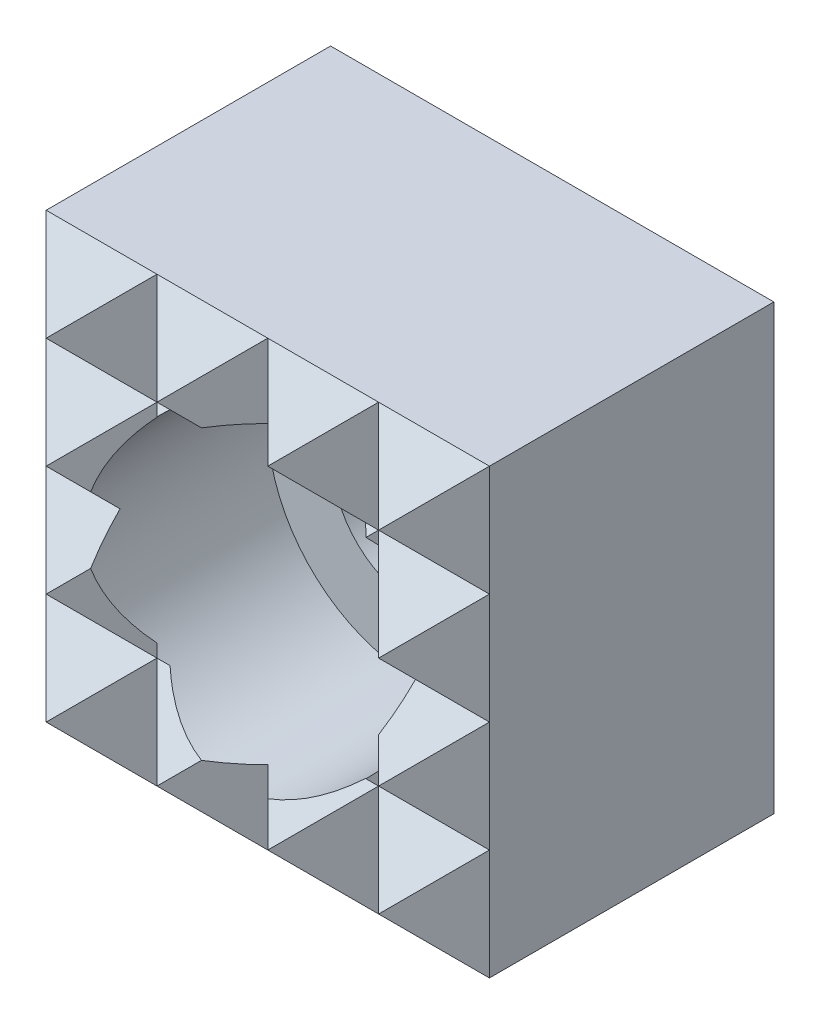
ISO-10303-21;
HEADER;
FILE_DESCRIPTION(('STEP AP214'),'2;1');
FILE_NAME('part.step','',(''),(''),'','','');
FILE_SCHEMA(('AUTOMOTIVE_DESIGN { 1 0 10303 214 1 1 1 1 }'));
ENDSEC;
DATA;
#1=APPLICATION_CONTEXT('core data for automotive mechanical design processes');
#2=APPLICATION_PROTOCOL_DEFINITION('international standard','automotive_design',2000,#1);
#3=PRODUCT_CONTEXT('',#1,'mechanical');
#4=PRODUCT('Part','Part','',(#3));
#5=PRODUCT_RELATED_PRODUCT_CATEGORY('part','',(#4));
#6=PRODUCT_DEFINITION_FORMATION('','',#4);
#7=PRODUCT_DEFINITION_CONTEXT('part definition',#1,'design');
#8=PRODUCT_DEFINITION('design','',#6,#7);
#9=PRODUCT_DEFINITION_SHAPE('','',#8);
#10=(LENGTH_UNIT() NAMED_UNIT(*) SI_UNIT(.MILLI.,.METRE.));
#11=(NAMED_UNIT(*) PLANE_ANGLE_UNIT() SI_UNIT($,.RADIAN.));
#12=(NAMED_UNIT(*) SI_UNIT($,.STERADIAN.) SOLID_ANGLE_UNIT());
#13=UNCERTAINTY_MEASURE_WITH_UNIT(LENGTH_MEASURE(1.E-05),#10,'distance_accuracy_value','');
#14=(GEOMETRIC_REPRESENTATION_CONTEXT(3) GLOBAL_UNCERTAINTY_ASSIGNED_CONTEXT((#13)) GLOBAL_UNIT_ASSIGNED_CONTEXT((#10,
#11,#12)) REPRESENTATION_CONTEXT('',''));
#15=CARTESIAN_POINT('',(0.,0.,0.));
#16=DIRECTION('',(0.,0.,1.));
#17=DIRECTION('',(1.,0.,0.));
#18=AXIS2_PLACEMENT_3D('',#15,#16,#17);
#19=CARTESIAN_POINT('',(-3.,-10.,8.5));
#20=DIRECTION('',(0.707106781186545,0.,-0.70710678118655));
#21=DIRECTION('',(-0.70710678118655,0.,-0.707106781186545));
#22=AXIS2_PLACEMENT_3D('',#19,#20,#21);
#23=PLANE('',#22);
#24=DIRECTION('',(0.,1.,0.));
#25=VECTOR('',#24,1.);
#26=CARTESIAN_POINT('',(-3.,-10.,8.5));
#27=LINE('',#26,#25);
#28=CARTESIAN_POINT('',(-3.,-3.,8.5));
#29=VERTEX_POINT('',#28);
#30=CARTESIAN_POINT('',(-3.,-2.64575131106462,8.5));
#31=VERTEX_POINT('',#30);
#32=EDGE_CURVE('E282',#29,#31,#27,.T.);
#33=ORIENTED_EDGE('',*,*,#32,.F.);
#34=DIRECTION('',(0.577350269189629,0.577350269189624,0.577350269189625));
#35=VECTOR('',#34,1.);
#36=CARTESIAN_POINT('',(-5.33333333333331,-5.33333333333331,6.16666666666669));
#37=LINE('',#36,#35);
#38=CARTESIAN_POINT('',(-2.82842712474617,-2.8284271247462,8.6715728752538));
#39=VERTEX_POINT('',#38);
#40=EDGE_CURVE('E400',#29,#39,#37,.T.);
#41=ORIENTED_EDGE('',*,*,#40,.T.);
#42=CARTESIAN_POINT('',(0.,0.,11.5));
#43=DIRECTION('',(0.707106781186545,0.,-0.70710678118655));
#44=DIRECTION('',(0.70710678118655,0.,0.707106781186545));
#45=AXIS2_PLACEMENT_3D('',#42,#43,#44);
#46=ELLIPSE('',#45,5.65685424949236,4.);
#47=EDGE_CURVE('E341',#39,#31,#46,.T.);
#48=ORIENTED_EDGE('',*,*,#47,.T.);
#49=EDGE_LOOP('',(#33,#41,#48));
#50=FACE_BOUND('',#49,.T.);
#51=ADVANCED_FACE('F14',(#50),#23,.F.);
#52=CARTESIAN_POINT('',(1.5,-10.,10.));
#53=DIRECTION('',(-0.707106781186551,0.,-0.707106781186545));
#54=DIRECTION('',(-0.707106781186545,0.,0.707106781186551));
#55=AXIS2_PLACEMENT_3D('',#52,#53,#54);
#56=PLANE('',#55);
#57=DIRECTION('',(0.,1.,0.));
#58=VECTOR('',#57,1.);
#59=CARTESIAN_POINT('',(3.,-10.,8.5));
#60=LINE('',#59,#58);
#61=CARTESIAN_POINT('',(3.,2.64575131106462,8.5));
#62=VERTEX_POINT('',#61);
#63=CARTESIAN_POINT('',(3.,3.,8.5));
#64=VERTEX_POINT('',#63);
#65=EDGE_CURVE('E702',#62,#64,#60,.T.);
#66=ORIENTED_EDGE('',*,*,#65,.T.);
#67=DIRECTION('',(-0.577350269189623,-0.577350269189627,0.577350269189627));
#68=VECTOR('',#67,1.);
#69=CARTESIAN_POINT('',(-2.33333333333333,-2.33333333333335,13.8333333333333));
#70=LINE('',#69,#68);
#71=CARTESIAN_POINT('',(2.82842712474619,2.8284271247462,8.6715728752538));
#72=VERTEX_POINT('',#71);
#73=EDGE_CURVE('E421',#64,#72,#70,.T.);
#74=ORIENTED_EDGE('',*,*,#73,.T.);
#75=CARTESIAN_POINT('',(0.,0.,11.5));
#76=DIRECTION('',(-0.707106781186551,0.,-0.707106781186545));
#77=DIRECTION('',(-0.707106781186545,0.,0.707106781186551));
#78=AXIS2_PLACEMENT_3D('',#75,#76,#77);
#79=ELLIPSE('',#78,5.6568542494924,4.);
#80=EDGE_CURVE('E353',#72,#62,#79,.T.);
#81=ORIENTED_EDGE('',*,*,#80,.T.);
#82=EDGE_LOOP('',(#66,#74,#81));
#83=FACE_BOUND('',#82,.T.);
#84=ADVANCED_FACE('F578',(#83),#56,.F.);
#85=CARTESIAN_POINT('',(-3.,2.64575131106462,8.5));
#86=VERTEX_POINT('',#85);
#87=CARTESIAN_POINT('',(-2.82842712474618,2.8284271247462,8.6715728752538));
#88=VERTEX_POINT('',#87);
#89=EDGE_CURVE('E338',#86,#88,#46,.T.);
#90=ORIENTED_EDGE('',*,*,#89,.T.);
#91=DIRECTION('',(-0.577350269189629,0.577350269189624,-0.577350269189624));
#92=VECTOR('',#91,1.);
#93=CARTESIAN_POINT('',(1.33333333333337,-1.33333333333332,12.8333333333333));
#94=LINE('',#93,#92);
#95=CARTESIAN_POINT('',(-2.99999999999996,3.,8.5));
#96=VERTEX_POINT('',#95);
#97=EDGE_CURVE('E257',#88,#96,#94,.T.);
#98=ORIENTED_EDGE('',*,*,#97,.T.);
#99=EDGE_CURVE('E279',#86,#96,#27,.T.);
#100=ORIENTED_EDGE('',*,*,#99,.F.);
#101=EDGE_LOOP('',(#90,#98,#100));
#102=FACE_BOUND('',#101,.T.);
#103=ADVANCED_FACE('F575',(#102),#23,.F.);
#104=CARTESIAN_POINT('',(3.,-2.64575131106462,8.5));
#105=VERTEX_POINT('',#104);
#106=CARTESIAN_POINT('',(2.82842712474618,-2.8284271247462,8.6715728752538));
#107=VERTEX_POINT('',#106);
#108=EDGE_CURVE('E350',#105,#107,#79,.T.);
#109=ORIENTED_EDGE('',*,*,#108,.T.);
#110=DIRECTION('',(0.577350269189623,-0.577350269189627,-0.577350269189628));
#111=VECTOR('',#110,1.);
#112=CARTESIAN_POINT('',(4.33333333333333,-4.33333333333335,7.16666666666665));
#113=LINE('',#112,#111);
#114=CARTESIAN_POINT('',(3.,-3.,8.5));
#115=VERTEX_POINT('',#114);
#116=EDGE_CURVE('E465',#107,#115,#113,.T.);
#117=ORIENTED_EDGE('',*,*,#116,.T.);
#118=EDGE_CURVE('E704',#115,#105,#60,.T.);
#119=ORIENTED_EDGE('',*,*,#118,.T.);
#120=EDGE_LOOP('',(#109,#117,#119));
#121=FACE_BOUND('',#120,.T.);
#122=ADVANCED_FACE('F577',(#121),#56,.F.);
#123=CARTESIAN_POINT('',(3.,-10.,8.5));
#124=DIRECTION('',(0.707106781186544,0.,-0.707106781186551));
#125=DIRECTION('',(-0.707106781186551,0.,-0.707106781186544));
#126=AXIS2_PLACEMENT_3D('',#123,#124,#125);
#127=PLANE('',#126);
#128=DIRECTION('',(0.57735026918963,0.577350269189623,0.577350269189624));
#129=VECTOR('',#128,1.);
#130=CARTESIAN_POINT('',(0.666666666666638,-5.33333333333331,6.16666666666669));
#131=LINE('',#130,#129);
#132=CARTESIAN_POINT('',(4.49999999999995,-1.5,10.));
#133=VERTEX_POINT('',#132);
#134=EDGE_CURVE('E468',#115,#133,#131,.T.);
#135=ORIENTED_EDGE('',*,*,#134,.T.);
#136=DIRECTION('',(-0.57735026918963,0.577350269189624,-0.577350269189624));
#137=VECTOR('',#136,1.);
#138=CARTESIAN_POINT('',(6.33333333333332,-3.33333333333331,11.8333333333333));
#139=LINE('',#138,#137);
#140=CARTESIAN_POINT('',(3.89791576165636,-0.897915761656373,9.39791576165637));
#141=VERTEX_POINT('',#140);
#142=EDGE_CURVE('E453',#133,#141,#139,.T.);
#143=ORIENTED_EDGE('',*,*,#142,.T.);
#144=CARTESIAN_POINT('',(0.,0.,5.5));
#145=DIRECTION('',(0.707106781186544,0.,-0.707106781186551));
#146=DIRECTION('',(0.707106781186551,0.,0.707106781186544));
#147=AXIS2_PLACEMENT_3D('',#144,#145,#146);
#148=ELLIPSE('',#147,5.65685424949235,4.);
#149=EDGE_CURVE('E357',#141,#105,#148,.T.);
#150=ORIENTED_EDGE('',*,*,#149,.T.);
#151=ORIENTED_EDGE('',*,*,#118,.F.);
#152=EDGE_LOOP('',(#135,#143,#150,#151));
#153=FACE_BOUND('',#152,.T.);
#154=ADVANCED_FACE('F586',(#153),#127,.F.);
#155=CARTESIAN_POINT('',(3.89791576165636,0.897915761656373,9.39791576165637));
#156=VERTEX_POINT('',#155);
#157=EDGE_CURVE('E354',#62,#156,#148,.T.);
#158=ORIENTED_EDGE('',*,*,#157,.T.);
#159=DIRECTION('',(0.57735026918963,0.577350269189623,0.577350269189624));
#160=VECTOR('',#159,1.);
#161=CARTESIAN_POINT('',(-0.333333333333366,-3.33333333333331,5.16666666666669));
#162=LINE('',#161,#160);
#163=CARTESIAN_POINT('',(4.49999999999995,1.5,10.));
#164=VERTEX_POINT('',#163);
#165=EDGE_CURVE('E443',#156,#164,#162,.T.);
#166=ORIENTED_EDGE('',*,*,#165,.T.);
#167=DIRECTION('',(-0.57735026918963,0.577350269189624,-0.577350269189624));
#168=VECTOR('',#167,1.);
#169=CARTESIAN_POINT('',(7.33333333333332,-1.33333333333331,12.8333333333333));
#170=LINE('',#169,#168);
#171=EDGE_CURVE('E429',#164,#64,#170,.T.);
#172=ORIENTED_EDGE('',*,*,#171,.T.);
#173=ORIENTED_EDGE('',*,*,#65,.F.);
#174=EDGE_LOOP('',(#158,#166,#172,#173));
#175=FACE_BOUND('',#174,.T.);
#176=ADVANCED_FACE('F764',(#175),#127,.F.);
#177=CARTESIAN_POINT('',(4.5,-10.,10.));
#178=DIRECTION('',(-0.707106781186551,0.,-0.707106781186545));
#179=DIRECTION('',(-0.707106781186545,0.,0.707106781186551));
#180=AXIS2_PLACEMENT_3D('',#177,#178,#179);
#181=PLANE('',#180);
#182=DIRECTION('',(-0.577350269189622,-0.577350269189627,0.577350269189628));
#183=VECTOR('',#182,1.);
#184=CARTESIAN_POINT('',(2.66666666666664,-6.33333333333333,11.8333333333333));
#185=LINE('',#184,#183);
#186=CARTESIAN_POINT('',(6.,-3.,8.5));
#187=VERTEX_POINT('',#186);
#188=CARTESIAN_POINT('',(4.5,-4.5,10.));
#189=VERTEX_POINT('',#188);
#190=EDGE_CURVE('E486',#187,#189,#185,.T.);
#191=ORIENTED_EDGE('',*,*,#190,.T.);
#192=DIRECTION('',(0.577350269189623,-0.577350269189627,-0.577350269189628));
#193=VECTOR('',#192,1.);
#194=CARTESIAN_POINT('',(6.33333333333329,-6.33333333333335,8.16666666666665));
#195=LINE('',#194,#193);
#196=CARTESIAN_POINT('',(6.,-6.,8.5));
#197=VERTEX_POINT('',#196);
#198=EDGE_CURVE('E494',#189,#197,#195,.T.);
#199=ORIENTED_EDGE('',*,*,#198,.T.);
#200=DIRECTION('',(0.,1.,0.));
#201=VECTOR('',#200,1.);
#202=CARTESIAN_POINT('',(6.,-10.,8.5));
#203=LINE('',#202,#201);
#204=EDGE_CURVE('E277',#197,#187,#203,.T.);
#205=ORIENTED_EDGE('',*,*,#204,.T.);
#206=EDGE_LOOP('',(#191,#199,#205));
#207=FACE_BOUND('',#206,.T.);
#208=ADVANCED_FACE('F735',(#207),#181,.F.);
#209=DIRECTION('',(-0.577350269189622,-0.577350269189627,0.577350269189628));
#210=VECTOR('',#209,1.);
#211=CARTESIAN_POINT('',(1.66666666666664,-4.33333333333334,12.8333333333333));
#212=LINE('',#211,#210);
#213=CARTESIAN_POINT('',(6.,0.,8.5));
#214=VERTEX_POINT('',#213);
#215=EDGE_CURVE('E456',#214,#133,#212,.T.);
#216=ORIENTED_EDGE('',*,*,#215,.T.);
#217=DIRECTION('',(0.577350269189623,-0.577350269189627,-0.577350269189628));
#218=VECTOR('',#217,1.);
#219=CARTESIAN_POINT('',(7.33333333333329,-4.33333333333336,7.16666666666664));
#220=LINE('',#219,#218);
#221=EDGE_CURVE('E471',#133,#187,#220,.T.);
#222=ORIENTED_EDGE('',*,*,#221,.T.);
#223=EDGE_CURVE('E696',#187,#214,#203,.T.);
#224=ORIENTED_EDGE('',*,*,#223,.T.);
#225=EDGE_LOOP('',(#216,#222,#224));
#226=FACE_BOUND('',#225,.T.);
#227=ADVANCED_FACE('F776',(#226),#181,.F.);
#228=DIRECTION('',(-0.577350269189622,-0.577350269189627,0.577350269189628));
#229=VECTOR('',#228,1.);
#230=CARTESIAN_POINT('',(0.666666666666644,-2.33333333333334,13.8333333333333));
#231=LINE('',#230,#229);
#232=CARTESIAN_POINT('',(6.,3.,8.5));
#233=VERTEX_POINT('',#232);
#234=EDGE_CURVE('E433',#233,#164,#231,.T.);
#235=ORIENTED_EDGE('',*,*,#234,.T.);
#236=DIRECTION('',(0.577350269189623,-0.577350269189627,-0.577350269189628));
#237=VECTOR('',#236,1.);
#238=CARTESIAN_POINT('',(8.33333333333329,-2.33333333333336,6.16666666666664));
#239=LINE('',#238,#237);
#240=EDGE_CURVE('E446',#164,#214,#239,.T.);
#241=ORIENTED_EDGE('',*,*,#240,.T.);
#242=EDGE_CURVE('E693',#214,#233,#203,.T.);
#243=ORIENTED_EDGE('',*,*,#242,.T.);
#244=EDGE_LOOP('',(#235,#241,#243));
#245=FACE_BOUND('',#244,.T.);
#246=ADVANCED_FACE('F695',(#245),#181,.F.);
#247=CARTESIAN_POINT('',(-6.,-10.,8.5));
#248=DIRECTION('',(0.707106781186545,0.,-0.70710678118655));
#249=DIRECTION('',(-0.70710678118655,0.,-0.707106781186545));
#250=AXIS2_PLACEMENT_3D('',#247,#248,#249);
#251=PLANE('',#250);
#252=DIRECTION('',(0.,1.,0.));
#253=VECTOR('',#252,1.);
#254=CARTESIAN_POINT('',(-6.,-10.,8.5));
#255=LINE('',#254,#253);
#256=CARTESIAN_POINT('',(-6.,-6.,8.5));
#257=VERTEX_POINT('',#256);
#258=CARTESIAN_POINT('',(-6.,-3.,8.5));
#259=VERTEX_POINT('',#258);
#260=EDGE_CURVE('E268',#257,#259,#255,.T.);
#261=ORIENTED_EDGE('',*,*,#260,.F.);
#262=DIRECTION('',(0.577350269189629,0.577350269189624,0.577350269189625));
#263=VECTOR('',#262,1.);
#264=CARTESIAN_POINT('',(-7.33333333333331,-7.33333333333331,7.16666666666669));
#265=LINE('',#264,#263);
#266=CARTESIAN_POINT('',(-4.49999999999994,-4.5,10.));
#267=VERTEX_POINT('',#266);
#268=EDGE_CURVE('E509',#257,#267,#265,.T.);
#269=ORIENTED_EDGE('',*,*,#268,.T.);
#270=DIRECTION('',(-0.577350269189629,0.577350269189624,-0.577350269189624));
#271=VECTOR('',#270,1.);
#272=CARTESIAN_POINT('',(-3.66666666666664,-5.33333333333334,10.8333333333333));
#273=LINE('',#272,#271);
#274=EDGE_CURVE('E393',#267,#259,#273,.T.);
#275=ORIENTED_EDGE('',*,*,#274,.T.);
#276=EDGE_LOOP('',(#261,#269,#275));
#277=FACE_BOUND('',#276,.T.);
#278=ADVANCED_FACE('F797',(#277),#251,.F.);
#279=CARTESIAN_POINT('',(-6.,0.,8.5));
#280=VERTEX_POINT('',#279);
#281=EDGE_CURVE('E273',#259,#280,#255,.T.);
#282=ORIENTED_EDGE('',*,*,#281,.F.);
#283=DIRECTION('',(0.577350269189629,0.577350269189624,0.577350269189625));
#284=VECTOR('',#283,1.);
#285=CARTESIAN_POINT('',(-8.33333333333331,-5.3333333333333,6.16666666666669));
#286=LINE('',#285,#284);
#287=CARTESIAN_POINT('',(-4.49999999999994,-1.5,10.));
#288=VERTEX_POINT('',#287);
#289=EDGE_CURVE('E381',#259,#288,#286,.T.);
#290=ORIENTED_EDGE('',*,*,#289,.T.);
#291=DIRECTION('',(-0.577350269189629,0.577350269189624,-0.577350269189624));
#292=VECTOR('',#291,1.);
#293=CARTESIAN_POINT('',(-2.66666666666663,-3.33333333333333,11.8333333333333));
#294=LINE('',#293,#292);
#295=EDGE_CURVE('E461',#288,#280,#294,.T.);
#296=ORIENTED_EDGE('',*,*,#295,.T.);
#297=EDGE_LOOP('',(#282,#290,#296));
#298=FACE_BOUND('',#297,.T.);
#299=ADVANCED_FACE('F799',(#298),#251,.F.);
#300=CARTESIAN_POINT('',(-6.,3.,8.5));
#301=VERTEX_POINT('',#300);
#302=EDGE_CURVE('E254',#280,#301,#255,.T.);
#303=ORIENTED_EDGE('',*,*,#302,.F.);
#304=DIRECTION('',(0.577350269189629,0.577350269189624,0.577350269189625));
#305=VECTOR('',#304,1.);
#306=CARTESIAN_POINT('',(-9.33333333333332,-3.33333333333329,5.1666666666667));
#307=LINE('',#306,#305);
#308=CARTESIAN_POINT('',(-4.49999999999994,1.5,10.));
#309=VERTEX_POINT('',#308);
#310=EDGE_CURVE('E256',#280,#309,#307,.T.);
#311=ORIENTED_EDGE('',*,*,#310,.T.);
#312=DIRECTION('',(-0.577350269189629,0.577350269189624,-0.577350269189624));
#313=VECTOR('',#312,1.);
#314=CARTESIAN_POINT('',(-1.66666666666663,-1.33333333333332,12.8333333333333));
#315=LINE('',#314,#313);
#316=EDGE_CURVE('E241',#309,#301,#315,.T.);
#317=ORIENTED_EDGE('',*,*,#316,.T.);
#318=EDGE_LOOP('',(#303,#311,#317));
#319=FACE_BOUND('',#318,.T.);
#320=ADVANCED_FACE('F252',(#319),#251,.F.);
#321=CARTESIAN_POINT('',(-4.5,-10.,10.));
#322=DIRECTION('',(-0.70710678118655,0.,-0.707106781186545));
#323=DIRECTION('',(-0.707106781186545,0.,0.70710678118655));
#324=AXIS2_PLACEMENT_3D('',#321,#322,#323);
#325=PLANE('',#324);
#326=CARTESIAN_POINT('',(0.,0.,5.5));
#327=DIRECTION('',(-0.70710678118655,0.,-0.707106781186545));
#328=DIRECTION('',(-0.707106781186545,0.,0.70710678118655));
#329=AXIS2_PLACEMENT_3D('',#326,#327,#328);
#330=ELLIPSE('',#329,5.6568542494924,4.);
#331=CARTESIAN_POINT('',(-3.89791576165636,-0.897915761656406,9.3979157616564));
#332=VERTEX_POINT('',#331);
#333=EDGE_CURVE('E335',#31,#332,#330,.T.);
#334=ORIENTED_EDGE('',*,*,#333,.T.);
#335=DIRECTION('',(-0.577350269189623,-0.577350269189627,0.577350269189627));
#336=VECTOR('',#335,1.);
#337=CARTESIAN_POINT('',(-7.33333333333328,-4.33333333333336,12.8333333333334));
#338=LINE('',#337,#336);
#339=EDGE_CURVE('E9',#332,#288,#338,.T.);
#340=ORIENTED_EDGE('',*,*,#339,.T.);
#341=DIRECTION('',(0.577350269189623,-0.577350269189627,-0.577350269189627));
#342=VECTOR('',#341,1.);
#343=CARTESIAN_POINT('',(-1.66666666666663,-4.33333333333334,7.16666666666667));
#344=LINE('',#343,#342);
#345=EDGE_CURVE('E22',#288,#29,#344,.T.);
#346=ORIENTED_EDGE('',*,*,#345,.T.);
#347=ORIENTED_EDGE('',*,*,#32,.T.);
#348=EDGE_LOOP('',(#334,#340,#346,#347));
#349=FACE_BOUND('',#348,.T.);
#350=ADVANCED_FACE('F374',(#349),#325,.F.);
#351=DIRECTION('',(-0.577350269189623,-0.577350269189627,0.577350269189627));
#352=VECTOR('',#351,1.);
#353=CARTESIAN_POINT('',(-8.33333333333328,-2.33333333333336,13.8333333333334));
#354=LINE('',#353,#352);
#355=EDGE_CURVE('E244',#96,#309,#354,.T.);
#356=ORIENTED_EDGE('',*,*,#355,.T.);
#357=DIRECTION('',(0.577350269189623,-0.577350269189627,-0.577350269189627));
#358=VECTOR('',#357,1.);
#359=CARTESIAN_POINT('',(-0.666666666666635,-2.33333333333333,6.16666666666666));
#360=LINE('',#359,#358);
#361=CARTESIAN_POINT('',(-3.89791576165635,0.897915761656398,9.3979157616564));
#362=VERTEX_POINT('',#361);
#363=EDGE_CURVE('E362',#309,#362,#360,.T.);
#364=ORIENTED_EDGE('',*,*,#363,.T.);
#365=EDGE_CURVE('E323',#362,#86,#330,.T.);
#366=ORIENTED_EDGE('',*,*,#365,.T.);
#367=ORIENTED_EDGE('',*,*,#99,.T.);
#368=EDGE_LOOP('',(#356,#364,#366,#367));
#369=FACE_BOUND('',#368,.T.);
#370=ADVANCED_FACE('F574',(#369),#325,.F.);
#371=CARTESIAN_POINT('',(-6.,-6.,0.));
#372=DIRECTION('',(0.,0.,-1.));
#373=DIRECTION('',(-1.,0.,0.));
#374=AXIS2_PLACEMENT_3D('',#371,#372,#373);
#375=PLANE('',#374);
#376=DIRECTION('',(1.,0.,0.));
#377=VECTOR('',#376,1.);
#378=CARTESIAN_POINT('',(-6.,5.2,0.));
#379=LINE('',#378,#377);
#380=CARTESIAN_POINT('',(-5.2,5.2,0.));
#381=VERTEX_POINT('',#380);
#382=CARTESIAN_POINT('',(5.2,5.2,0.));
#383=VERTEX_POINT('',#382);
#384=EDGE_CURVE('E305',#381,#383,#379,.T.);
#385=ORIENTED_EDGE('',*,*,#384,.T.);
#386=DIRECTION('',(0.,-1.,0.));
#387=VECTOR('',#386,1.);
#388=CARTESIAN_POINT('',(5.2,-6.,0.));
#389=LINE('',#388,#387);
#390=CARTESIAN_POINT('',(5.2,-5.2,0.));
#391=VERTEX_POINT('',#390);
#392=EDGE_CURVE('E311',#383,#391,#389,.T.);
#393=ORIENTED_EDGE('',*,*,#392,.T.);
#394=DIRECTION('',(-1.,0.,0.));
#395=VECTOR('',#394,1.);
#396=CARTESIAN_POINT('',(-6.,-5.2,0.));
#397=LINE('',#396,#395);
#398=CARTESIAN_POINT('',(-5.2,-5.2,0.));
#399=VERTEX_POINT('',#398);
#400=EDGE_CURVE('E309',#391,#399,#397,.T.);
#401=ORIENTED_EDGE('',*,*,#400,.T.);
#402=DIRECTION('',(0.,1.,0.));
#403=VECTOR('',#402,1.);
#404=CARTESIAN_POINT('',(-5.2,6.,0.));
#405=LINE('',#404,#403);
#406=EDGE_CURVE('E307',#399,#381,#405,.T.);
#407=ORIENTED_EDGE('',*,*,#406,.T.);
#408=EDGE_LOOP('',(#385,#393,#401,#407));
#409=FACE_BOUND('',#408,.T.);
#410=CARTESIAN_POINT('',(0.,0.,0.));
#411=DIRECTION('',(0.,0.,-1.));
#412=DIRECTION('',(-1.,0.,0.));
#413=AXIS2_PLACEMENT_3D('',#410,#411,#412);
#414=CIRCLE('',#413,2.25);
#415=CARTESIAN_POINT('',(-2.25,0.,0.));
#416=VERTEX_POINT('',#415);
#417=EDGE_CURVE('E291',#416,#416,#414,.F.);
#418=ORIENTED_EDGE('',*,*,#417,.T.);
#419=EDGE_LOOP('',(#418));
#420=FACE_BOUND('',#419,.T.);
#421=ADVANCED_FACE('F1075',(#409,#420),#375,.T.);
#422=CARTESIAN_POINT('',(-6.,6.,10.));
#423=DIRECTION('',(1.,0.,0.));
#424=DIRECTION('',(0.,1.,0.));
#425=AXIS2_PLACEMENT_3D('',#422,#423,#424);
#426=PLANE('',#425);
#427=DIRECTION('',(0.,0.,-1.));
#428=VECTOR('',#427,1.);
#429=CARTESIAN_POINT('',(-6.,-6.,10.));
#430=LINE('',#429,#428);
#431=CARTESIAN_POINT('',(-6.,-6.,0.8));
#432=VERTEX_POINT('',#431);
#433=EDGE_CURVE('E298',#257,#432,#430,.T.);
#434=ORIENTED_EDGE('',*,*,#433,.F.);
#435=ORIENTED_EDGE('',*,*,#260,.T.);
#436=ORIENTED_EDGE('',*,*,#281,.T.);
#437=ORIENTED_EDGE('',*,*,#302,.T.);
#438=CARTESIAN_POINT('',(-6.,6.,8.5));
#439=VERTEX_POINT('',#438);
#440=EDGE_CURVE('E261',#301,#439,#255,.T.);
#441=ORIENTED_EDGE('',*,*,#440,.T.);
#442=DIRECTION('',(0.,0.,-1.));
#443=VECTOR('',#442,1.);
#444=CARTESIAN_POINT('',(-6.,6.,10.));
#445=LINE('',#444,#443);
#446=CARTESIAN_POINT('',(-6.,6.,0.8));
#447=VERTEX_POINT('',#446);
#448=EDGE_CURVE('E292',#439,#447,#445,.T.);
#449=ORIENTED_EDGE('',*,*,#448,.T.);
#450=DIRECTION('',(0.,-1.,0.));
#451=VECTOR('',#450,1.);
#452=CARTESIAN_POINT('',(-6.,-6.,0.8));
#453=LINE('',#452,#451);
#454=EDGE_CURVE('E317',#447,#432,#453,.T.);
#455=ORIENTED_EDGE('',*,*,#454,.T.);
#456=EDGE_LOOP('',(#434,#435,#436,#437,#441,#449,#455));
#457=FACE_BOUND('',#456,.T.);
#458=ADVANCED_FACE('F270',(#457),#426,.F.);
#459=CARTESIAN_POINT('',(6.,-6.,10.));
#460=DIRECTION('',(0.,-1.,0.));
#461=DIRECTION('',(1.,0.,0.));
#462=AXIS2_PLACEMENT_3D('',#459,#460,#461);
#463=PLANE('',#462);
#464=DIRECTION('',(1.,0.,0.));
#465=VECTOR('',#464,1.);
#466=CARTESIAN_POINT('',(-10.,-6.,8.5));
#467=LINE('',#466,#465);
#468=CARTESIAN_POINT('',(-2.99999999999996,-6.,8.5));
#469=VERTEX_POINT('',#468);
#470=EDGE_CURVE('E555',#257,#469,#467,.T.);
#471=ORIENTED_EDGE('',*,*,#470,.F.);
#472=ORIENTED_EDGE('',*,*,#433,.T.);
#473=DIRECTION('',(1.,0.,0.));
#474=VECTOR('',#473,1.);
#475=CARTESIAN_POINT('',(6.,-6.,0.8));
#476=LINE('',#475,#474);
#477=CARTESIAN_POINT('',(6.,-6.,0.8));
#478=VERTEX_POINT('',#477);
#479=EDGE_CURVE('E314',#432,#478,#476,.T.);
#480=ORIENTED_EDGE('',*,*,#479,.T.);
#481=DIRECTION('',(0.,0.,-1.));
#482=VECTOR('',#481,1.);
#483=CARTESIAN_POINT('',(6.,-6.,10.));
#484=LINE('',#483,#482);
#485=EDGE_CURVE('E296',#197,#478,#484,.T.);
#486=ORIENTED_EDGE('',*,*,#485,.F.);
#487=CARTESIAN_POINT('',(3.,-6.,8.5));
#488=VERTEX_POINT('',#487);
#489=EDGE_CURVE('E553',#488,#197,#467,.T.);
#490=ORIENTED_EDGE('',*,*,#489,.F.);
#491=CARTESIAN_POINT('',(0.,-6.,8.5));
#492=VERTEX_POINT('',#491);
#493=EDGE_CURVE('E554',#492,#488,#467,.T.);
#494=ORIENTED_EDGE('',*,*,#493,.F.);
#495=EDGE_CURVE('E750',#469,#492,#467,.T.);
#496=ORIENTED_EDGE('',*,*,#495,.F.);
#497=EDGE_LOOP('',(#471,#472,#480,#486,#490,#494,#496));
#498=FACE_BOUND('',#497,.T.);
#499=ADVANCED_FACE('F744',(#498),#463,.T.);
#500=CARTESIAN_POINT('',(6.,-6.,10.));
#501=DIRECTION('',(-1.,0.,0.));
#502=DIRECTION('',(0.,0.,1.));
#503=AXIS2_PLACEMENT_3D('',#500,#501,#502);
#504=PLANE('',#503);
#505=DIRECTION('',(0.,0.,-1.));
#506=VECTOR('',#505,1.);
#507=CARTESIAN_POINT('',(6.,6.,10.));
#508=LINE('',#507,#506);
#509=CARTESIAN_POINT('',(6.,6.,8.5));
#510=VERTEX_POINT('',#509);
#511=CARTESIAN_POINT('',(6.,6.,0.8));
#512=VERTEX_POINT('',#511);
#513=EDGE_CURVE('E294',#510,#512,#508,.T.);
#514=ORIENTED_EDGE('',*,*,#513,.F.);
#515=EDGE_CURVE('E276',#233,#510,#203,.T.);
#516=ORIENTED_EDGE('',*,*,#515,.F.);
#517=ORIENTED_EDGE('',*,*,#242,.F.);
#518=ORIENTED_EDGE('',*,*,#223,.F.);
#519=ORIENTED_EDGE('',*,*,#204,.F.);
#520=ORIENTED_EDGE('',*,*,#485,.T.);
#521=DIRECTION('',(0.,1.,0.));
#522=VECTOR('',#521,1.);
#523=CARTESIAN_POINT('',(6.,6.,0.8));
#524=LINE('',#523,#522);
#525=EDGE_CURVE('E300',#478,#512,#524,.T.);
#526=ORIENTED_EDGE('',*,*,#525,.T.);
#527=EDGE_LOOP('',(#514,#516,#517,#518,#519,#520,#526));
#528=FACE_BOUND('',#527,.T.);
#529=ADVANCED_FACE('F691',(#528),#504,.F.);
#530=CARTESIAN_POINT('',(-6.,6.,10.));
#531=DIRECTION('',(0.,1.,0.));
#532=DIRECTION('',(0.,0.,1.));
#533=AXIS2_PLACEMENT_3D('',#530,#531,#532);
#534=PLANE('',#533);
#535=DIRECTION('',(1.,0.,0.));
#536=VECTOR('',#535,1.);
#537=CARTESIAN_POINT('',(-10.,6.,8.5));
#538=LINE('',#537,#536);
#539=CARTESIAN_POINT('',(3.,6.,8.5));
#540=VERTEX_POINT('',#539);
#541=EDGE_CURVE('E245',#540,#510,#538,.T.);
#542=ORIENTED_EDGE('',*,*,#541,.T.);
#543=ORIENTED_EDGE('',*,*,#513,.T.);
#544=DIRECTION('',(-1.,0.,0.));
#545=VECTOR('',#544,1.);
#546=CARTESIAN_POINT('',(-6.,6.,0.8));
#547=LINE('',#546,#545);
#548=EDGE_CURVE('E320',#512,#447,#547,.T.);
#549=ORIENTED_EDGE('',*,*,#548,.T.);
#550=ORIENTED_EDGE('',*,*,#448,.F.);
#551=CARTESIAN_POINT('',(-2.99999999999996,6.,8.5));
#552=VERTEX_POINT('',#551);
#553=EDGE_CURVE('E552',#439,#552,#538,.T.);
#554=ORIENTED_EDGE('',*,*,#553,.T.);
#555=CARTESIAN_POINT('',(0.,6.,8.5));
#556=VERTEX_POINT('',#555);
#557=EDGE_CURVE('E618',#552,#556,#538,.T.);
#558=ORIENTED_EDGE('',*,*,#557,.T.);
#559=EDGE_CURVE('E551',#556,#540,#538,.T.);
#560=ORIENTED_EDGE('',*,*,#559,.T.);
#561=EDGE_LOOP('',(#542,#543,#549,#550,#554,#558,#560));
#562=FACE_BOUND('',#561,.T.);
#563=ADVANCED_FACE('F630',(#562),#534,.T.);
#564=CARTESIAN_POINT('',(0.,0.,10.));
#565=DIRECTION('',(0.,0.,1.));
#566=DIRECTION('',(1.,0.,0.));
#567=AXIS2_PLACEMENT_3D('',#564,#565,#566);
#568=CYLINDRICAL_SURFACE('',#567,4.);
#569=CARTESIAN_POINT('',(0.,0.,8.5));
#570=DIRECTION('',(0.,0.707106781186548,-0.707106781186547));
#571=DIRECTION('',(0.,0.707106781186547,0.707106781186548));
#572=AXIS2_PLACEMENT_3D('',#569,#570,#571);
#573=ELLIPSE('',#572,5.65685424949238,4.);
#574=CARTESIAN_POINT('',(-4.,0.,8.5));
#575=VERTEX_POINT('',#574);
#576=EDGE_CURVE('E449',#575,#362,#573,.T.);
#577=ORIENTED_EDGE('',*,*,#576,.F.);
#578=CARTESIAN_POINT('',(0.,0.,8.5));
#579=DIRECTION('',(0.,-0.707106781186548,-0.707106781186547));
#580=DIRECTION('',(0.,-0.707106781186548,0.707106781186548));
#581=AXIS2_PLACEMENT_3D('',#578,#579,#580);
#582=ELLIPSE('',#581,5.65685424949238,4.);
#583=EDGE_CURVE('E459',#332,#575,#582,.T.);
#584=ORIENTED_EDGE('',*,*,#583,.F.);
#585=ORIENTED_EDGE('',*,*,#333,.F.);
#586=ORIENTED_EDGE('',*,*,#47,.F.);
#587=CARTESIAN_POINT('',(0.,0.,11.5));
#588=DIRECTION('',(0.,0.707106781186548,-0.707106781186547));
#589=DIRECTION('',(0.,0.707106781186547,0.707106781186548));
#590=AXIS2_PLACEMENT_3D('',#587,#588,#589);
#591=ELLIPSE('',#590,5.65685424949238,4.);
#592=CARTESIAN_POINT('',(-2.64575131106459,-3.,8.5));
#593=VERTEX_POINT('',#592);
#594=EDGE_CURVE('E404',#593,#39,#591,.T.);
#595=ORIENTED_EDGE('',*,*,#594,.F.);
#596=CARTESIAN_POINT('',(0.,0.,5.5));
#597=DIRECTION('',(0.,-0.707106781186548,-0.707106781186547));
#598=DIRECTION('',(0.,-0.707106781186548,0.707106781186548));
#599=AXIS2_PLACEMENT_3D('',#596,#597,#598);
#600=ELLIPSE('',#599,5.65685424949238,4.);
#601=CARTESIAN_POINT('',(-0.897915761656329,-3.89791576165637,9.39791576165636));
#602=VERTEX_POINT('',#601);
#603=EDGE_CURVE('E414',#602,#593,#600,.T.);
#604=ORIENTED_EDGE('',*,*,#603,.F.);
#605=CARTESIAN_POINT('',(0.,0.,8.5));
#606=DIRECTION('',(-0.70710678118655,0.,-0.707106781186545));
#607=DIRECTION('',(-0.707106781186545,0.,0.70710678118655));
#608=AXIS2_PLACEMENT_3D('',#605,#606,#607);
#609=ELLIPSE('',#608,5.6568542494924,4.);
#610=CARTESIAN_POINT('',(0.,-4.,8.5));
#611=VERTEX_POINT('',#610);
#612=EDGE_CURVE('E342',#611,#602,#609,.T.);
#613=ORIENTED_EDGE('',*,*,#612,.F.);
#614=CARTESIAN_POINT('',(0.,0.,8.5));
#615=DIRECTION('',(0.707106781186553,0.,-0.707106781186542));
#616=DIRECTION('',(0.707106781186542,0.,0.707106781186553));
#617=AXIS2_PLACEMENT_3D('',#614,#615,#616);
#618=ELLIPSE('',#617,5.65685424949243,4.);
#619=CARTESIAN_POINT('',(0.897915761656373,-3.89791576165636,9.39791576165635));
#620=VERTEX_POINT('',#619);
#621=EDGE_CURVE('E349',#620,#611,#618,.T.);
#622=ORIENTED_EDGE('',*,*,#621,.F.);
#623=CARTESIAN_POINT('',(2.64575131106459,-3.,8.5));
#624=VERTEX_POINT('',#623);
#625=EDGE_CURVE('E476',#624,#620,#600,.T.);
#626=ORIENTED_EDGE('',*,*,#625,.F.);
#627=EDGE_CURVE('E464',#107,#624,#591,.T.);
#628=ORIENTED_EDGE('',*,*,#627,.F.);
#629=ORIENTED_EDGE('',*,*,#108,.F.);
#630=ORIENTED_EDGE('',*,*,#149,.F.);
#631=CARTESIAN_POINT('',(4.,0.,8.5));
#632=VERTEX_POINT('',#631);
#633=EDGE_CURVE('E452',#632,#141,#582,.T.);
#634=ORIENTED_EDGE('',*,*,#633,.F.);
#635=EDGE_CURVE('E258',#156,#632,#573,.T.);
#636=ORIENTED_EDGE('',*,*,#635,.F.);
#637=ORIENTED_EDGE('',*,*,#157,.F.);
#638=ORIENTED_EDGE('',*,*,#80,.F.);
#639=CARTESIAN_POINT('',(0.,0.,11.5));
#640=DIRECTION('',(0.,-0.707106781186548,-0.707106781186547));
#641=DIRECTION('',(0.,-0.707106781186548,0.707106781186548));
#642=AXIS2_PLACEMENT_3D('',#639,#640,#641);
#643=ELLIPSE('',#642,5.65685424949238,4.);
#644=CARTESIAN_POINT('',(2.64575131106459,3.,8.5));
#645=VERTEX_POINT('',#644);
#646=EDGE_CURVE('E417',#645,#72,#643,.T.);
#647=ORIENTED_EDGE('',*,*,#646,.F.);
#648=CARTESIAN_POINT('',(0.,0.,5.5));
#649=DIRECTION('',(0.,0.707106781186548,-0.707106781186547));
#650=DIRECTION('',(0.,0.707106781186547,0.707106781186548));
#651=AXIS2_PLACEMENT_3D('',#648,#649,#650);
#652=ELLIPSE('',#651,5.65685424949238,4.);
#653=CARTESIAN_POINT('',(0.897915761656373,3.89791576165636,9.39791576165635));
#654=VERTEX_POINT('',#653);
#655=EDGE_CURVE('E529',#654,#645,#652,.T.);
#656=ORIENTED_EDGE('',*,*,#655,.F.);
#657=CARTESIAN_POINT('',(0.,4.,8.5));
#658=VERTEX_POINT('',#657);
#659=EDGE_CURVE('E346',#658,#654,#618,.T.);
#660=ORIENTED_EDGE('',*,*,#659,.F.);
#661=CARTESIAN_POINT('',(-0.897915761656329,3.89791576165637,9.39791576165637));
#662=VERTEX_POINT('',#661);
#663=EDGE_CURVE('E345',#662,#658,#609,.T.);
#664=ORIENTED_EDGE('',*,*,#663,.F.);
#665=CARTESIAN_POINT('',(-2.64575131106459,3.,8.5));
#666=VERTEX_POINT('',#665);
#667=EDGE_CURVE('E542',#666,#662,#652,.T.);
#668=ORIENTED_EDGE('',*,*,#667,.F.);
#669=EDGE_CURVE('E423',#88,#666,#643,.T.);
#670=ORIENTED_EDGE('',*,*,#669,.F.);
#671=ORIENTED_EDGE('',*,*,#89,.F.);
#672=ORIENTED_EDGE('',*,*,#365,.F.);
#673=EDGE_LOOP('',(#577,#584,#585,#586,#595,#604,#613,#622,#626,#628,#629,#630,#634,#636,#637,
#638,#647,#656,#660,#664,#668,#670,#671,#672));
#674=FACE_BOUND('',#673,.T.);
#675=CARTESIAN_POINT('',(0.,0.,4.5));
#676=DIRECTION('',(0.,0.,1.));
#677=DIRECTION('',(1.,0.,0.));
#678=AXIS2_PLACEMENT_3D('',#675,#676,#677);
#679=CIRCLE('',#678,4.);
#680=CARTESIAN_POINT('',(4.,0.,4.5));
#681=VERTEX_POINT('',#680);
#682=EDGE_CURVE('E287',#681,#681,#679,.T.);
#683=ORIENTED_EDGE('',*,*,#682,.F.);
#684=EDGE_LOOP('',(#683));
#685=FACE_BOUND('',#684,.T.);
#686=ADVANCED_FACE('F570',(#674,#685),#568,.F.);
#687=CARTESIAN_POINT('',(2.25,0.,4.5));
#688=DIRECTION('',(0.,0.,1.));
#689=DIRECTION('',(1.,0.,0.));
#690=AXIS2_PLACEMENT_3D('',#687,#688,#689);
#691=PLANE('',#690);
#692=ORIENTED_EDGE('',*,*,#682,.T.);
#693=EDGE_LOOP('',(#692));
#694=FACE_BOUND('',#693,.T.);
#695=CARTESIAN_POINT('',(0.,0.,4.5));
#696=DIRECTION('',(0.,0.,1.));
#697=DIRECTION('',(1.,0.,0.));
#698=AXIS2_PLACEMENT_3D('',#695,#696,#697);
#699=CIRCLE('',#698,2.25);
#700=CARTESIAN_POINT('',(2.25,0.,4.5));
#701=VERTEX_POINT('',#700);
#702=EDGE_CURVE('E284',#701,#701,#699,.T.);
#703=ORIENTED_EDGE('',*,*,#702,.F.);
#704=EDGE_LOOP('',(#703));
#705=FACE_BOUND('',#704,.T.);
#706=ADVANCED_FACE('F1124',(#694,#705),#691,.T.);
#707=CARTESIAN_POINT('',(0.,0.,10.));
#708=DIRECTION('',(0.,0.,1.));
#709=DIRECTION('',(1.,0.,0.));
#710=AXIS2_PLACEMENT_3D('',#707,#708,#709);
#711=CYLINDRICAL_SURFACE('',#710,2.25);
#712=ORIENTED_EDGE('',*,*,#417,.F.);
#713=EDGE_LOOP('',(#712));
#714=FACE_BOUND('',#713,.T.);
#715=ORIENTED_EDGE('',*,*,#702,.T.);
#716=EDGE_LOOP('',(#715));
#717=FACE_BOUND('',#716,.T.);
#718=ADVANCED_FACE('F1133',(#714,#717),#711,.F.);
#719=CARTESIAN_POINT('',(-6.,6.,0.8));
#720=DIRECTION('',(-0.707106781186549,0.,-0.707106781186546));
#721=DIRECTION('',(-0.707106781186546,0.,0.707106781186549));
#722=AXIS2_PLACEMENT_3D('',#719,#720,#721);
#723=PLANE('',#722);
#724=DIRECTION('',(0.577350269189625,-0.577350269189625,-0.577350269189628));
#725=VECTOR('',#724,1.);
#726=CARTESIAN_POINT('',(-5.46666666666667,5.46666666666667,0.266666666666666));
#727=LINE('',#726,#725);
#728=EDGE_CURVE('E330',#381,#447,#727,.F.);
#729=ORIENTED_EDGE('',*,*,#728,.F.);
#730=ORIENTED_EDGE('',*,*,#406,.F.);
#731=DIRECTION('',(0.577350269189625,0.577350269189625,-0.577350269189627));
#732=VECTOR('',#731,1.);
#733=CARTESIAN_POINT('',(-2.,-2.,-3.2));
#734=LINE('',#733,#732);
#735=EDGE_CURVE('E288',#432,#399,#734,.T.);
#736=ORIENTED_EDGE('',*,*,#735,.F.);
#737=ORIENTED_EDGE('',*,*,#454,.F.);
#738=EDGE_LOOP('',(#729,#730,#736,#737));
#739=FACE_BOUND('',#738,.T.);
#740=ADVANCED_FACE('F16',(#739),#723,.T.);
#741=CARTESIAN_POINT('',(-6.,-5.2,0.));
#742=DIRECTION('',(0.,0.707106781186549,0.707106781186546));
#743=DIRECTION('',(0.,-0.707106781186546,0.707106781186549));
#744=AXIS2_PLACEMENT_3D('',#741,#742,#743);
#745=PLANE('',#744);
#746=ORIENTED_EDGE('',*,*,#735,.T.);
#747=ORIENTED_EDGE('',*,*,#400,.F.);
#748=DIRECTION('',(-0.577350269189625,0.577350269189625,-0.577350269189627));
#749=VECTOR('',#748,1.);
#750=CARTESIAN_POINT('',(1.46666666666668,-1.46666666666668,-3.73333333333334));
#751=LINE('',#750,#749);
#752=EDGE_CURVE('E327',#478,#391,#751,.T.);
#753=ORIENTED_EDGE('',*,*,#752,.F.);
#754=ORIENTED_EDGE('',*,*,#479,.F.);
#755=EDGE_LOOP('',(#746,#747,#753,#754));
#756=FACE_BOUND('',#755,.T.);
#757=ADVANCED_FACE('F782',(#756),#745,.F.);
#758=CARTESIAN_POINT('',(-6.,5.2,0.));
#759=DIRECTION('',(0.,-0.707106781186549,0.707106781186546));
#760=DIRECTION('',(0.,-0.707106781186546,-0.707106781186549));
#761=AXIS2_PLACEMENT_3D('',#758,#759,#760);
#762=PLANE('',#761);
#763=ORIENTED_EDGE('',*,*,#728,.T.);
#764=ORIENTED_EDGE('',*,*,#548,.F.);
#765=DIRECTION('',(0.577350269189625,0.577350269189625,0.577350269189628));
#766=VECTOR('',#765,1.);
#767=CARTESIAN_POINT('',(1.46666666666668,1.46666666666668,-3.73333333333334));
#768=LINE('',#767,#766);
#769=EDGE_CURVE('E324',#383,#512,#768,.T.);
#770=ORIENTED_EDGE('',*,*,#769,.F.);
#771=ORIENTED_EDGE('',*,*,#384,.F.);
#772=EDGE_LOOP('',(#763,#764,#770,#771));
#773=FACE_BOUND('',#772,.T.);
#774=ADVANCED_FACE('F790',(#773),#762,.F.);
#775=CARTESIAN_POINT('',(6.,-6.,0.8));
#776=DIRECTION('',(0.707106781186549,0.,-0.707106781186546));
#777=DIRECTION('',(-0.707106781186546,0.,-0.707106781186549));
#778=AXIS2_PLACEMENT_3D('',#775,#776,#777);
#779=PLANE('',#778);
#780=ORIENTED_EDGE('',*,*,#752,.T.);
#781=ORIENTED_EDGE('',*,*,#392,.F.);
#782=ORIENTED_EDGE('',*,*,#769,.T.);
#783=ORIENTED_EDGE('',*,*,#525,.F.);
#784=EDGE_LOOP('',(#780,#781,#782,#783));
#785=FACE_BOUND('',#784,.T.);
#786=ADVANCED_FACE('F785',(#785),#779,.T.);
#787=CARTESIAN_POINT('',(-1.49999999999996,-10.,10.));
#788=DIRECTION('',(-0.70710678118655,0.,-0.707106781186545));
#789=DIRECTION('',(-0.707106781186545,0.,0.70710678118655));
#790=AXIS2_PLACEMENT_3D('',#787,#788,#789);
#791=PLANE('',#790);
#792=DIRECTION('',(0.,1.,0.));
#793=VECTOR('',#792,1.);
#794=CARTESIAN_POINT('',(0.,-10.,8.5));
#795=LINE('',#794,#793);
#796=EDGE_CURVE('E615',#658,#556,#795,.T.);
#797=ORIENTED_EDGE('',*,*,#796,.T.);
#798=DIRECTION('',(-0.577350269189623,-0.577350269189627,0.577350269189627));
#799=VECTOR('',#798,1.);
#800=CARTESIAN_POINT('',(-6.33333333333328,-0.333333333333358,14.8333333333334));
#801=LINE('',#800,#799);
#802=CARTESIAN_POINT('',(-1.49999999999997,4.5,10.));
#803=VERTEX_POINT('',#802);
#804=EDGE_CURVE('E522',#556,#803,#801,.T.);
#805=ORIENTED_EDGE('',*,*,#804,.T.);
#806=DIRECTION('',(0.577350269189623,-0.577350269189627,-0.577350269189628));
#807=VECTOR('',#806,1.);
#808=CARTESIAN_POINT('',(3.33333333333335,-0.333333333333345,5.16666666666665));
#809=LINE('',#808,#807);
#810=EDGE_CURVE('E29',#803,#662,#809,.T.);
#811=ORIENTED_EDGE('',*,*,#810,.T.);
#812=ORIENTED_EDGE('',*,*,#663,.T.);
#813=EDGE_LOOP('',(#797,#805,#811,#812));
#814=FACE_BOUND('',#813,.T.);
#815=ADVANCED_FACE('F612',(#814),#791,.F.);
#816=CARTESIAN_POINT('',(0.,-10.,8.5));
#817=DIRECTION('',(0.707106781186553,0.,-0.707106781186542));
#818=DIRECTION('',(-0.707106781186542,0.,-0.707106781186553));
#819=AXIS2_PLACEMENT_3D('',#816,#817,#818);
#820=PLANE('',#819);
#821=DIRECTION('',(0.57735026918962,0.577350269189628,0.577350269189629));
#822=VECTOR('',#821,1.);
#823=CARTESIAN_POINT('',(-1.33333333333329,-7.33333333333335,7.16666666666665));
#824=LINE('',#823,#822);
#825=CARTESIAN_POINT('',(1.5,-4.5,10.));
#826=VERTEX_POINT('',#825);
#827=EDGE_CURVE('E503',#492,#826,#824,.T.);
#828=ORIENTED_EDGE('',*,*,#827,.T.);
#829=DIRECTION('',(-0.57735026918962,0.577350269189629,-0.577350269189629));
#830=VECTOR('',#829,1.);
#831=CARTESIAN_POINT('',(2.33333333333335,-5.33333333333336,10.8333333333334));
#832=LINE('',#831,#830);
#833=EDGE_CURVE('E477',#826,#620,#832,.T.);
#834=ORIENTED_EDGE('',*,*,#833,.T.);
#835=ORIENTED_EDGE('',*,*,#621,.T.);
#836=EDGE_CURVE('E328',#492,#611,#795,.T.);
#837=ORIENTED_EDGE('',*,*,#836,.F.);
#838=EDGE_LOOP('',(#828,#834,#835,#837));
#839=FACE_BOUND('',#838,.T.);
#840=ADVANCED_FACE('F760',(#839),#820,.F.);
#841=ORIENTED_EDGE('',*,*,#612,.T.);
#842=DIRECTION('',(-0.577350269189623,-0.577350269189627,0.577350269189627));
#843=VECTOR('',#842,1.);
#844=CARTESIAN_POINT('',(-3.33333333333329,-6.33333333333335,11.8333333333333));
#845=LINE('',#844,#843);
#846=CARTESIAN_POINT('',(-1.49999999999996,-4.5,10.));
#847=VERTEX_POINT('',#846);
#848=EDGE_CURVE('E489',#602,#847,#845,.T.);
#849=ORIENTED_EDGE('',*,*,#848,.T.);
#850=DIRECTION('',(0.577350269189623,-0.577350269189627,-0.577350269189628));
#851=VECTOR('',#850,1.);
#852=CARTESIAN_POINT('',(0.333333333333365,-6.33333333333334,8.16666666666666));
#853=LINE('',#852,#851);
#854=EDGE_CURVE('E37',#847,#492,#853,.T.);
#855=ORIENTED_EDGE('',*,*,#854,.T.);
#856=ORIENTED_EDGE('',*,*,#836,.T.);
#857=EDGE_LOOP('',(#841,#849,#855,#856));
#858=FACE_BOUND('',#857,.T.);
#859=ADVANCED_FACE('F755',(#858),#791,.F.);
#860=DIRECTION('',(0.57735026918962,0.577350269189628,0.577350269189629));
#861=VECTOR('',#860,1.);
#862=CARTESIAN_POINT('',(-4.33333333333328,-1.33333333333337,4.16666666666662));
#863=LINE('',#862,#861);
#864=CARTESIAN_POINT('',(1.5,4.5,10.));
#865=VERTEX_POINT('',#864);
#866=EDGE_CURVE('E530',#654,#865,#863,.T.);
#867=ORIENTED_EDGE('',*,*,#866,.T.);
#868=DIRECTION('',(-0.57735026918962,0.577350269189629,-0.577350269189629));
#869=VECTOR('',#868,1.);
#870=CARTESIAN_POINT('',(5.33333333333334,0.666666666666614,13.8333333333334));
#871=LINE('',#870,#869);
#872=EDGE_CURVE('E519',#865,#556,#871,.T.);
#873=ORIENTED_EDGE('',*,*,#872,.T.);
#874=ORIENTED_EDGE('',*,*,#796,.F.);
#875=ORIENTED_EDGE('',*,*,#659,.T.);
#876=EDGE_LOOP('',(#867,#873,#874,#875));
#877=FACE_BOUND('',#876,.T.);
#878=ADVANCED_FACE('F622',(#877),#820,.F.);
#879=ORIENTED_EDGE('',*,*,#515,.T.);
#880=DIRECTION('',(-0.577350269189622,-0.577350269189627,0.577350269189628));
#881=VECTOR('',#880,1.);
#882=CARTESIAN_POINT('',(-0.333333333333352,-0.333333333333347,14.8333333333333));
#883=LINE('',#882,#881);
#884=CARTESIAN_POINT('',(4.5,4.5,10.));
#885=VERTEX_POINT('',#884);
#886=EDGE_CURVE('E511',#510,#885,#883,.T.);
#887=ORIENTED_EDGE('',*,*,#886,.T.);
#888=DIRECTION('',(0.577350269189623,-0.577350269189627,-0.577350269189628));
#889=VECTOR('',#888,1.);
#890=CARTESIAN_POINT('',(9.33333333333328,-0.333333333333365,5.16666666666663));
#891=LINE('',#890,#889);
#892=EDGE_CURVE('E539',#885,#233,#891,.T.);
#893=ORIENTED_EDGE('',*,*,#892,.T.);
#894=EDGE_LOOP('',(#879,#887,#893));
#895=FACE_BOUND('',#894,.T.);
#896=ADVANCED_FACE('F687',(#895),#181,.F.);
#897=DIRECTION('',(0.577350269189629,0.577350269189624,0.577350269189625));
#898=VECTOR('',#897,1.);
#899=CARTESIAN_POINT('',(-10.3333333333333,-1.33333333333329,4.16666666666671));
#900=LINE('',#899,#898);
#901=CARTESIAN_POINT('',(-4.5,4.5,10.));
#902=VERTEX_POINT('',#901);
#903=EDGE_CURVE('E224',#301,#902,#900,.T.);
#904=ORIENTED_EDGE('',*,*,#903,.T.);
#905=DIRECTION('',(-0.577350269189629,0.577350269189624,-0.577350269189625));
#906=VECTOR('',#905,1.);
#907=CARTESIAN_POINT('',(-0.666666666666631,0.666666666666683,13.8333333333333));
#908=LINE('',#907,#906);
#909=EDGE_CURVE('E263',#902,#439,#908,.T.);
#910=ORIENTED_EDGE('',*,*,#909,.T.);
#911=ORIENTED_EDGE('',*,*,#440,.F.);
#912=EDGE_LOOP('',(#904,#910,#911));
#913=FACE_BOUND('',#912,.T.);
#914=ADVANCED_FACE('F262',(#913),#251,.F.);
#915=CARTESIAN_POINT('',(-10.,4.5,10.));
#916=DIRECTION('',(0.,0.707106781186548,-0.707106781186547));
#917=DIRECTION('',(0.,0.707106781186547,0.707106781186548));
#918=AXIS2_PLACEMENT_3D('',#915,#916,#917);
#919=PLANE('',#918);
#920=DIRECTION('',(1.,0.,0.));
#921=VECTOR('',#920,1.);
#922=CARTESIAN_POINT('',(-10.,3.,8.5));
#923=LINE('',#922,#921);
#924=EDGE_CURVE('E227',#301,#96,#923,.T.);
#925=ORIENTED_EDGE('',*,*,#924,.T.);
#926=DIRECTION('',(0.577350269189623,-0.577350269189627,-0.577350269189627));
#927=VECTOR('',#926,1.);
#928=CARTESIAN_POINT('',(0.333333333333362,-0.333333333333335,5.16666666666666));
#929=LINE('',#928,#927);
#930=EDGE_CURVE('E230',#902,#96,#929,.T.);
#931=ORIENTED_EDGE('',*,*,#930,.F.);
#932=ORIENTED_EDGE('',*,*,#903,.F.);
#933=EDGE_LOOP('',(#925,#931,#932));
#934=FACE_BOUND('',#933,.T.);
#935=ADVANCED_FACE('F226',(#934),#919,.F.);
#936=CARTESIAN_POINT('',(-10.,3.,8.5));
#937=DIRECTION('',(0.,-0.707106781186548,-0.707106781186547));
#938=DIRECTION('',(0.,0.707106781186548,-0.707106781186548));
#939=AXIS2_PLACEMENT_3D('',#936,#937,#938);
#940=PLANE('',#939);
#941=ORIENTED_EDGE('',*,*,#355,.F.);
#942=ORIENTED_EDGE('',*,*,#924,.F.);
#943=ORIENTED_EDGE('',*,*,#316,.F.);
#944=EDGE_LOOP('',(#941,#942,#943));
#945=FACE_BOUND('',#944,.T.);
#946=ADVANCED_FACE('F240',(#945),#940,.F.);
#947=CARTESIAN_POINT('',(-10.,6.,8.5));
#948=DIRECTION('',(0.,-0.707106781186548,-0.707106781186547));
#949=DIRECTION('',(0.,0.707106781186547,-0.707106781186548));
#950=AXIS2_PLACEMENT_3D('',#947,#948,#949);
#951=PLANE('',#950);
#952=DIRECTION('',(-0.577350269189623,-0.577350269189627,0.577350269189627));
#953=VECTOR('',#952,1.);
#954=CARTESIAN_POINT('',(-9.33333333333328,-0.333333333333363,14.8333333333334));
#955=LINE('',#954,#953);
#956=EDGE_CURVE('E359',#552,#902,#955,.T.);
#957=ORIENTED_EDGE('',*,*,#956,.F.);
#958=ORIENTED_EDGE('',*,*,#553,.F.);
#959=ORIENTED_EDGE('',*,*,#909,.F.);
#960=EDGE_LOOP('',(#957,#958,#959));
#961=FACE_BOUND('',#960,.T.);
#962=ADVANCED_FACE('F632',(#961),#951,.F.);
#963=CARTESIAN_POINT('',(-10.,-4.5,10.));
#964=DIRECTION('',(0.,0.707106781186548,-0.707106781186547));
#965=DIRECTION('',(0.,0.707106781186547,0.707106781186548));
#966=AXIS2_PLACEMENT_3D('',#963,#964,#965);
#967=PLANE('',#966);
#968=ORIENTED_EDGE('',*,*,#470,.T.);
#969=DIRECTION('',(0.577350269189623,-0.577350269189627,-0.577350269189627));
#970=VECTOR('',#969,1.);
#971=CARTESIAN_POINT('',(-2.66666666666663,-6.33333333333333,8.16666666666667));
#972=LINE('',#971,#970);
#973=EDGE_CURVE('E365',#267,#469,#972,.T.);
#974=ORIENTED_EDGE('',*,*,#973,.F.);
#975=ORIENTED_EDGE('',*,*,#268,.F.);
#976=EDGE_LOOP('',(#968,#974,#975));
#977=FACE_BOUND('',#976,.T.);
#978=ADVANCED_FACE('F634',(#977),#967,.F.);
#979=CARTESIAN_POINT('',(-10.,-3.,8.5));
#980=DIRECTION('',(0.,-0.707106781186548,-0.707106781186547));
#981=DIRECTION('',(0.,0.707106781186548,-0.707106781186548));
#982=AXIS2_PLACEMENT_3D('',#979,#980,#981);
#983=PLANE('',#982);
#984=DIRECTION('',(-0.577350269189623,-0.577350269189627,0.577350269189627));
#985=VECTOR('',#984,1.);
#986=CARTESIAN_POINT('',(-6.33333333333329,-6.33333333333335,11.8333333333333));
#987=LINE('',#986,#985);
#988=EDGE_CURVE('E368',#29,#267,#987,.T.);
#989=ORIENTED_EDGE('',*,*,#988,.F.);
#990=DIRECTION('',(1.,0.,0.));
#991=VECTOR('',#990,1.);
#992=CARTESIAN_POINT('',(-10.,-3.,8.5));
#993=LINE('',#992,#991);
#994=EDGE_CURVE('E383',#259,#29,#993,.T.);
#995=ORIENTED_EDGE('',*,*,#994,.F.);
#996=ORIENTED_EDGE('',*,*,#274,.F.);
#997=EDGE_LOOP('',(#989,#995,#996));
#998=FACE_BOUND('',#997,.T.);
#999=ADVANCED_FACE('F392',(#998),#983,.F.);
#1000=CARTESIAN_POINT('',(-10.,-1.5,10.));
#1001=DIRECTION('',(0.,0.707106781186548,-0.707106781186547));
#1002=DIRECTION('',(0.,0.707106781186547,0.707106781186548));
#1003=AXIS2_PLACEMENT_3D('',#1000,#1001,#1002);
#1004=PLANE('',#1003);
#1005=ORIENTED_EDGE('',*,*,#994,.T.);
#1006=ORIENTED_EDGE('',*,*,#345,.F.);
#1007=ORIENTED_EDGE('',*,*,#289,.F.);
#1008=EDGE_LOOP('',(#1005,#1006,#1007));
#1009=FACE_BOUND('',#1008,.T.);
#1010=ADVANCED_FACE('F380',(#1009),#1004,.F.);
#1011=CARTESIAN_POINT('',(-10.,0.,8.5));
#1012=DIRECTION('',(0.,-0.707106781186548,-0.707106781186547));
#1013=DIRECTION('',(0.,0.707106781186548,-0.707106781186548));
#1014=AXIS2_PLACEMENT_3D('',#1011,#1012,#1013);
#1015=PLANE('',#1014);
#1016=ORIENTED_EDGE('',*,*,#583,.T.);
#1017=DIRECTION('',(1.,0.,0.));
#1018=VECTOR('',#1017,1.);
#1019=CARTESIAN_POINT('',(-10.,0.,8.5));
#1020=LINE('',#1019,#1018);
#1021=EDGE_CURVE('E236',#280,#575,#1020,.T.);
#1022=ORIENTED_EDGE('',*,*,#1021,.F.);
#1023=ORIENTED_EDGE('',*,*,#295,.F.);
#1024=ORIENTED_EDGE('',*,*,#339,.F.);
#1025=EDGE_LOOP('',(#1016,#1022,#1023,#1024));
#1026=FACE_BOUND('',#1025,.T.);
#1027=ADVANCED_FACE('F800',(#1026),#1015,.F.);
#1028=CARTESIAN_POINT('',(-10.,1.5,10.));
#1029=DIRECTION('',(0.,0.707106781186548,-0.707106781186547));
#1030=DIRECTION('',(0.,0.707106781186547,0.707106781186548));
#1031=AXIS2_PLACEMENT_3D('',#1028,#1029,#1030);
#1032=PLANE('',#1031);
#1033=ORIENTED_EDGE('',*,*,#576,.T.);
#1034=ORIENTED_EDGE('',*,*,#363,.F.);
#1035=ORIENTED_EDGE('',*,*,#310,.F.);
#1036=ORIENTED_EDGE('',*,*,#1021,.T.);
#1037=EDGE_LOOP('',(#1033,#1034,#1035,#1036));
#1038=FACE_BOUND('',#1037,.T.);
#1039=ADVANCED_FACE('F565',(#1038),#1032,.F.);
#1040=EDGE_CURVE('E248',#64,#233,#923,.T.);
#1041=ORIENTED_EDGE('',*,*,#1040,.T.);
#1042=ORIENTED_EDGE('',*,*,#892,.F.);
#1043=DIRECTION('',(0.57735026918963,0.577350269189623,0.577350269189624));
#1044=VECTOR('',#1043,1.);
#1045=CARTESIAN_POINT('',(-1.33333333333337,-1.33333333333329,4.1666666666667));
#1046=LINE('',#1045,#1044);
#1047=EDGE_CURVE('E536',#64,#885,#1046,.T.);
#1048=ORIENTED_EDGE('',*,*,#1047,.F.);
#1049=EDGE_LOOP('',(#1041,#1042,#1048));
#1050=FACE_BOUND('',#1049,.T.);
#1051=ADVANCED_FACE('F669',(#1050),#919,.F.);
#1052=ORIENTED_EDGE('',*,*,#234,.F.);
#1053=ORIENTED_EDGE('',*,*,#1040,.F.);
#1054=ORIENTED_EDGE('',*,*,#171,.F.);
#1055=EDGE_LOOP('',(#1052,#1053,#1054));
#1056=FACE_BOUND('',#1055,.T.);
#1057=ADVANCED_FACE('F650',(#1056),#940,.F.);
#1058=ORIENTED_EDGE('',*,*,#541,.F.);
#1059=DIRECTION('',(-0.57735026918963,0.577350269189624,-0.577350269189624));
#1060=VECTOR('',#1059,1.);
#1061=CARTESIAN_POINT('',(8.33333333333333,0.666666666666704,13.8333333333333));
#1062=LINE('',#1061,#1060);
#1063=EDGE_CURVE('E513',#885,#540,#1062,.T.);
#1064=ORIENTED_EDGE('',*,*,#1063,.F.);
#1065=ORIENTED_EDGE('',*,*,#886,.F.);
#1066=EDGE_LOOP('',(#1058,#1064,#1065));
#1067=FACE_BOUND('',#1066,.T.);
#1068=ADVANCED_FACE('F636',(#1067),#951,.F.);
#1069=DIRECTION('',(0.57735026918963,0.577350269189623,0.577350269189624));
#1070=VECTOR('',#1069,1.);
#1071=CARTESIAN_POINT('',(1.66666666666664,-7.33333333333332,7.16666666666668));
#1072=LINE('',#1071,#1070);
#1073=EDGE_CURVE('E497',#488,#189,#1072,.T.);
#1074=ORIENTED_EDGE('',*,*,#1073,.F.);
#1075=ORIENTED_EDGE('',*,*,#489,.T.);
#1076=ORIENTED_EDGE('',*,*,#198,.F.);
#1077=EDGE_LOOP('',(#1074,#1075,#1076));
#1078=FACE_BOUND('',#1077,.T.);
#1079=ADVANCED_FACE('F643',(#1078),#967,.F.);
#1080=ORIENTED_EDGE('',*,*,#190,.F.);
#1081=EDGE_CURVE('E390',#115,#187,#993,.T.);
#1082=ORIENTED_EDGE('',*,*,#1081,.F.);
#1083=DIRECTION('',(-0.57735026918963,0.577350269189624,-0.577350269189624));
#1084=VECTOR('',#1083,1.);
#1085=CARTESIAN_POINT('',(5.33333333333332,-5.33333333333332,10.8333333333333));
#1086=LINE('',#1085,#1084);
#1087=EDGE_CURVE('E483',#189,#115,#1086,.T.);
#1088=ORIENTED_EDGE('',*,*,#1087,.F.);
#1089=EDGE_LOOP('',(#1080,#1082,#1088));
#1090=FACE_BOUND('',#1089,.T.);
#1091=ADVANCED_FACE('F733',(#1090),#983,.F.);
#1092=ORIENTED_EDGE('',*,*,#1081,.T.);
#1093=ORIENTED_EDGE('',*,*,#221,.F.);
#1094=ORIENTED_EDGE('',*,*,#134,.F.);
#1095=EDGE_LOOP('',(#1092,#1093,#1094));
#1096=FACE_BOUND('',#1095,.T.);
#1097=ADVANCED_FACE('F730',(#1096),#1004,.F.);
#1098=ORIENTED_EDGE('',*,*,#633,.T.);
#1099=ORIENTED_EDGE('',*,*,#142,.F.);
#1100=ORIENTED_EDGE('',*,*,#215,.F.);
#1101=EDGE_CURVE('E387',#632,#214,#1020,.T.);
#1102=ORIENTED_EDGE('',*,*,#1101,.F.);
#1103=EDGE_LOOP('',(#1098,#1099,#1100,#1102));
#1104=FACE_BOUND('',#1103,.T.);
#1105=ADVANCED_FACE('F775',(#1104),#1015,.F.);
#1106=ORIENTED_EDGE('',*,*,#635,.T.);
#1107=ORIENTED_EDGE('',*,*,#1101,.T.);
#1108=ORIENTED_EDGE('',*,*,#240,.F.);
#1109=ORIENTED_EDGE('',*,*,#165,.F.);
#1110=EDGE_LOOP('',(#1106,#1107,#1108,#1109));
#1111=FACE_BOUND('',#1110,.T.);
#1112=ADVANCED_FACE('F773',(#1111),#1032,.F.);
#1113=ORIENTED_EDGE('',*,*,#1047,.T.);
#1114=ORIENTED_EDGE('',*,*,#1063,.T.);
#1115=EDGE_CURVE('E699',#64,#540,#60,.T.);
#1116=ORIENTED_EDGE('',*,*,#1115,.F.);
#1117=EDGE_LOOP('',(#1113,#1114,#1116));
#1118=FACE_BOUND('',#1117,.T.);
#1119=ADVANCED_FACE('F768',(#1118),#127,.F.);
#1120=ORIENTED_EDGE('',*,*,#1115,.T.);
#1121=DIRECTION('',(-0.577350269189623,-0.577350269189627,0.577350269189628));
#1122=VECTOR('',#1121,1.);
#1123=CARTESIAN_POINT('',(-3.33333333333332,-0.333333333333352,14.8333333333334));
#1124=LINE('',#1123,#1122);
#1125=EDGE_CURVE('E516',#540,#865,#1124,.T.);
#1126=ORIENTED_EDGE('',*,*,#1125,.T.);
#1127=DIRECTION('',(0.577350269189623,-0.577350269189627,-0.577350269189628));
#1128=VECTOR('',#1127,1.);
#1129=CARTESIAN_POINT('',(6.33333333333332,-0.333333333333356,5.16666666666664));
#1130=LINE('',#1129,#1128);
#1131=EDGE_CURVE('E533',#865,#64,#1130,.T.);
#1132=ORIENTED_EDGE('',*,*,#1131,.T.);
#1133=EDGE_LOOP('',(#1120,#1126,#1132));
#1134=FACE_BOUND('',#1133,.T.);
#1135=ADVANCED_FACE('F589',(#1134),#56,.F.);
#1136=ORIENTED_EDGE('',*,*,#1073,.T.);
#1137=ORIENTED_EDGE('',*,*,#1087,.T.);
#1138=EDGE_CURVE('E703',#488,#115,#60,.T.);
#1139=ORIENTED_EDGE('',*,*,#1138,.F.);
#1140=EDGE_LOOP('',(#1136,#1137,#1139));
#1141=FACE_BOUND('',#1140,.T.);
#1142=ADVANCED_FACE('F747',(#1141),#127,.F.);
#1143=ORIENTED_EDGE('',*,*,#1138,.T.);
#1144=DIRECTION('',(-0.577350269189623,-0.577350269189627,0.577350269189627));
#1145=VECTOR('',#1144,1.);
#1146=CARTESIAN_POINT('',(-0.333333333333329,-6.33333333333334,11.8333333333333));
#1147=LINE('',#1146,#1145);
#1148=EDGE_CURVE('E480',#115,#826,#1147,.T.);
#1149=ORIENTED_EDGE('',*,*,#1148,.T.);
#1150=DIRECTION('',(0.577350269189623,-0.577350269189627,-0.577350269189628));
#1151=VECTOR('',#1150,1.);
#1152=CARTESIAN_POINT('',(3.33333333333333,-6.33333333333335,8.16666666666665));
#1153=LINE('',#1152,#1151);
#1154=EDGE_CURVE('E500',#826,#488,#1153,.T.);
#1155=ORIENTED_EDGE('',*,*,#1154,.T.);
#1156=EDGE_LOOP('',(#1143,#1149,#1155));
#1157=FACE_BOUND('',#1156,.T.);
#1158=ADVANCED_FACE('F591',(#1157),#56,.F.);
#1159=ORIENTED_EDGE('',*,*,#827,.F.);
#1160=ORIENTED_EDGE('',*,*,#493,.T.);
#1161=ORIENTED_EDGE('',*,*,#1154,.F.);
#1162=EDGE_LOOP('',(#1159,#1160,#1161));
#1163=FACE_BOUND('',#1162,.T.);
#1164=ADVANCED_FACE('F662',(#1163),#967,.F.);
#1165=ORIENTED_EDGE('',*,*,#625,.T.);
#1166=ORIENTED_EDGE('',*,*,#833,.F.);
#1167=ORIENTED_EDGE('',*,*,#1148,.F.);
#1168=EDGE_CURVE('E415',#624,#115,#993,.T.);
#1169=ORIENTED_EDGE('',*,*,#1168,.F.);
#1170=EDGE_LOOP('',(#1165,#1166,#1167,#1169));
#1171=FACE_BOUND('',#1170,.T.);
#1172=ADVANCED_FACE('F724',(#1171),#983,.F.);
#1173=ORIENTED_EDGE('',*,*,#627,.T.);
#1174=ORIENTED_EDGE('',*,*,#1168,.T.);
#1175=ORIENTED_EDGE('',*,*,#116,.F.);
#1176=EDGE_LOOP('',(#1173,#1174,#1175));
#1177=FACE_BOUND('',#1176,.T.);
#1178=ADVANCED_FACE('F667',(#1177),#1004,.F.);
#1179=ORIENTED_EDGE('',*,*,#655,.T.);
#1180=EDGE_CURVE('E548',#645,#64,#923,.T.);
#1181=ORIENTED_EDGE('',*,*,#1180,.T.);
#1182=ORIENTED_EDGE('',*,*,#1131,.F.);
#1183=ORIENTED_EDGE('',*,*,#866,.F.);
#1184=EDGE_LOOP('',(#1179,#1181,#1182,#1183));
#1185=FACE_BOUND('',#1184,.T.);
#1186=ADVANCED_FACE('F663',(#1185),#919,.F.);
#1187=ORIENTED_EDGE('',*,*,#646,.T.);
#1188=ORIENTED_EDGE('',*,*,#73,.F.);
#1189=ORIENTED_EDGE('',*,*,#1180,.F.);
#1190=EDGE_LOOP('',(#1187,#1188,#1189));
#1191=FACE_BOUND('',#1190,.T.);
#1192=ADVANCED_FACE('F647',(#1191),#940,.F.);
#1193=ORIENTED_EDGE('',*,*,#559,.F.);
#1194=ORIENTED_EDGE('',*,*,#872,.F.);
#1195=ORIENTED_EDGE('',*,*,#1125,.F.);
#1196=EDGE_LOOP('',(#1193,#1194,#1195));
#1197=FACE_BOUND('',#1196,.T.);
#1198=ADVANCED_FACE('F625',(#1197),#951,.F.);
#1199=DIRECTION('',(0.577350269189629,0.577350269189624,0.577350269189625));
#1200=VECTOR('',#1199,1.);
#1201=CARTESIAN_POINT('',(-4.33333333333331,-7.33333333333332,7.16666666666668));
#1202=LINE('',#1201,#1200);
#1203=EDGE_CURVE('E507',#469,#847,#1202,.T.);
#1204=ORIENTED_EDGE('',*,*,#1203,.F.);
#1205=ORIENTED_EDGE('',*,*,#495,.T.);
#1206=ORIENTED_EDGE('',*,*,#854,.F.);
#1207=EDGE_LOOP('',(#1204,#1205,#1206));
#1208=FACE_BOUND('',#1207,.T.);
#1209=ADVANCED_FACE('F644',(#1208),#967,.F.);
#1210=ORIENTED_EDGE('',*,*,#603,.T.);
#1211=EDGE_CURVE('E388',#29,#593,#993,.T.);
#1212=ORIENTED_EDGE('',*,*,#1211,.F.);
#1213=DIRECTION('',(-0.577350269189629,0.577350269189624,-0.577350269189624));
#1214=VECTOR('',#1213,1.);
#1215=CARTESIAN_POINT('',(-0.666666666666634,-5.33333333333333,10.8333333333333));
#1216=LINE('',#1215,#1214);
#1217=EDGE_CURVE('E411',#847,#29,#1216,.T.);
#1218=ORIENTED_EDGE('',*,*,#1217,.F.);
#1219=ORIENTED_EDGE('',*,*,#848,.F.);
#1220=EDGE_LOOP('',(#1210,#1212,#1218,#1219));
#1221=FACE_BOUND('',#1220,.T.);
#1222=ADVANCED_FACE('F409',(#1221),#983,.F.);
#1223=ORIENTED_EDGE('',*,*,#594,.T.);
#1224=ORIENTED_EDGE('',*,*,#40,.F.);
#1225=ORIENTED_EDGE('',*,*,#1211,.T.);
#1226=EDGE_LOOP('',(#1223,#1224,#1225));
#1227=FACE_BOUND('',#1226,.T.);
#1228=ADVANCED_FACE('F402',(#1227),#1004,.F.);
#1229=ORIENTED_EDGE('',*,*,#667,.T.);
#1230=ORIENTED_EDGE('',*,*,#810,.F.);
#1231=DIRECTION('',(0.577350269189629,0.577350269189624,0.577350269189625));
#1232=VECTOR('',#1231,1.);
#1233=CARTESIAN_POINT('',(-7.33333333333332,-1.33333333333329,4.1666666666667));
#1234=LINE('',#1233,#1232);
#1235=EDGE_CURVE('E235',#96,#803,#1234,.T.);
#1236=ORIENTED_EDGE('',*,*,#1235,.F.);
#1237=EDGE_CURVE('E246',#96,#666,#923,.T.);
#1238=ORIENTED_EDGE('',*,*,#1237,.T.);
#1239=EDGE_LOOP('',(#1229,#1230,#1236,#1238));
#1240=FACE_BOUND('',#1239,.T.);
#1241=ADVANCED_FACE('F656',(#1240),#919,.F.);
#1242=ORIENTED_EDGE('',*,*,#669,.T.);
#1243=ORIENTED_EDGE('',*,*,#1237,.F.);
#1244=ORIENTED_EDGE('',*,*,#97,.F.);
#1245=EDGE_LOOP('',(#1242,#1243,#1244));
#1246=FACE_BOUND('',#1245,.T.);
#1247=ADVANCED_FACE('F646',(#1246),#940,.F.);
#1248=ORIENTED_EDGE('',*,*,#557,.F.);
#1249=DIRECTION('',(-0.577350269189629,0.577350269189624,-0.577350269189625));
#1250=VECTOR('',#1249,1.);
#1251=CARTESIAN_POINT('',(2.33333333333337,0.66666666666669,13.8333333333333));
#1252=LINE('',#1251,#1250);
#1253=EDGE_CURVE('E525',#803,#552,#1252,.T.);
#1254=ORIENTED_EDGE('',*,*,#1253,.F.);
#1255=ORIENTED_EDGE('',*,*,#804,.F.);
#1256=EDGE_LOOP('',(#1248,#1254,#1255));
#1257=FACE_BOUND('',#1256,.T.);
#1258=ADVANCED_FACE('F608',(#1257),#951,.F.);
#1259=EDGE_CURVE('E283',#96,#552,#27,.T.);
#1260=ORIENTED_EDGE('',*,*,#1259,.T.);
#1261=ORIENTED_EDGE('',*,*,#956,.T.);
#1262=ORIENTED_EDGE('',*,*,#930,.T.);
#1263=EDGE_LOOP('',(#1260,#1261,#1262));
#1264=FACE_BOUND('',#1263,.T.);
#1265=ADVANCED_FACE('F602',(#1264),#325,.F.);
#1266=ORIENTED_EDGE('',*,*,#1235,.T.);
#1267=ORIENTED_EDGE('',*,*,#1253,.T.);
#1268=ORIENTED_EDGE('',*,*,#1259,.F.);
#1269=EDGE_LOOP('',(#1266,#1267,#1268));
#1270=FACE_BOUND('',#1269,.T.);
#1271=ADVANCED_FACE('F592',(#1270),#23,.F.);
#1272=EDGE_CURVE('E266',#469,#29,#27,.T.);
#1273=ORIENTED_EDGE('',*,*,#1272,.T.);
#1274=ORIENTED_EDGE('',*,*,#988,.T.);
#1275=ORIENTED_EDGE('',*,*,#973,.T.);
#1276=EDGE_LOOP('',(#1273,#1274,#1275));
#1277=FACE_BOUND('',#1276,.T.);
#1278=ADVANCED_FACE('F596',(#1277),#325,.F.);
#1279=ORIENTED_EDGE('',*,*,#1203,.T.);
#1280=ORIENTED_EDGE('',*,*,#1217,.T.);
#1281=ORIENTED_EDGE('',*,*,#1272,.F.);
#1282=EDGE_LOOP('',(#1279,#1280,#1281));
#1283=FACE_BOUND('',#1282,.T.);
#1284=ADVANCED_FACE('F580',(#1283),#23,.F.);
#1285=CLOSED_SHELL('',(#51,#84,#103,#122,#154,#176,#208,#227,#246,#278,#299,#320,#350,#370,#421,
#458,#499,#529,#563,#686,#706,#718,#740,#757,#774,#786,#815,#840,#859,#878,#896,#914,#935,#946,
#962,#978,#999,#1010,#1027,#1039,#1051,#1057,#1068,#1079,#1091,#1097,#1105,#1112,#1119,#1135,
#1142,#1158,#1164,#1172,#1178,#1186,#1192,#1198,#1209,#1222,#1228,#1241,#1247,#1258,#1265,#1271,
#1278,#1284));
#1286=MANIFOLD_SOLID_BREP('B1',#1285);
#1287=ADVANCED_BREP_SHAPE_REPRESENTATION('',(#18,#1286),#14);
#1288=SHAPE_DEFINITION_REPRESENTATION(#9,#1287);
ENDSEC;
END-ISO-10303-21;
